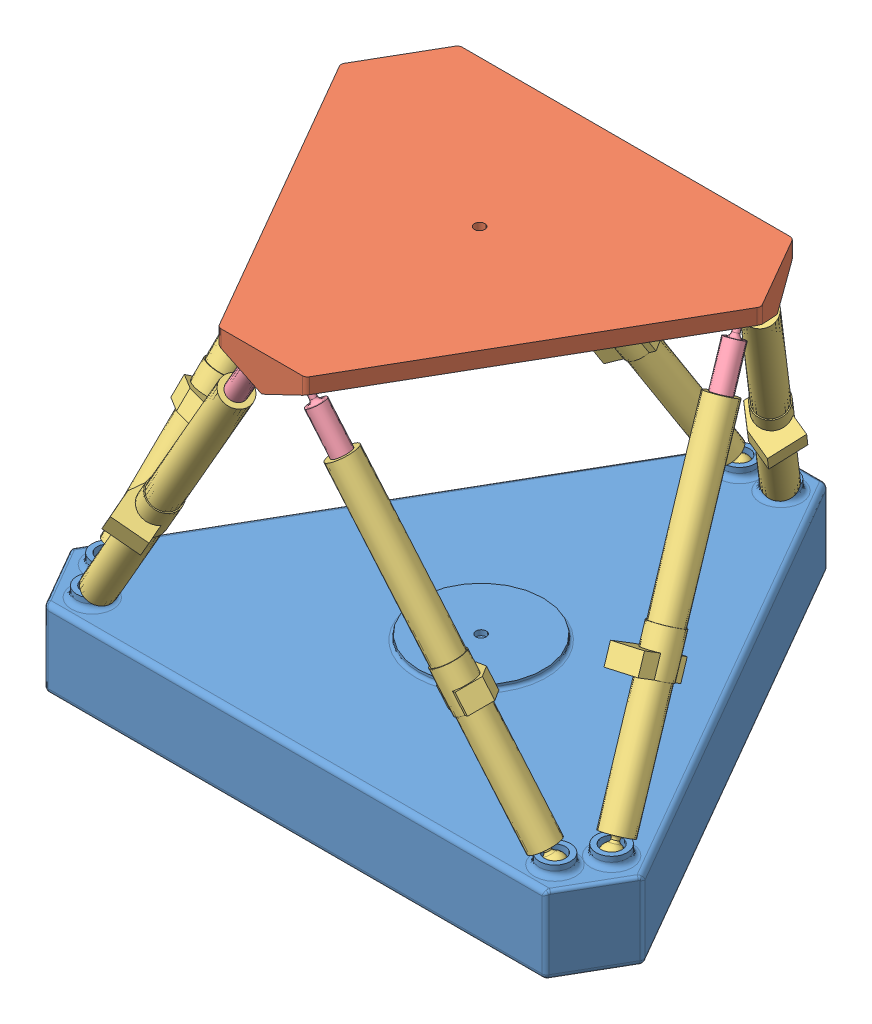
SolidWorks assembly 6axes.SLDASM, configuration Défaut (file format 4400). Lengths in mm.
Overall size (556.71 419.49 544.19).
14 component instances, 4 part files, 24 mates.
Components (placement in the parent):
- embase-1: embase.SLDPRT [Défaut] at (0 -80 0) size (550.45 85 478.05)
- plateforme-1: plateforme.SLDPRT [Défaut] at (-1.6309 324.4911 -0.1601) x (0.499978 0 0.866038) z (-0.866038 0 0.499978) size (404.45 35 351.61)
- alesage-1: alesage.SLDPRT [Défaut] at (20.0158 -5 -269.2534) x (0.278517 0.324523 -0.903943) z (0.895408 -0.428156 0.122176) size (36.78 335 45)
- tige-1: tige.SLDPRT [Défaut] at (90.6333 166.4569 -185.9407) x (0.687943 0.067774 -0.722594) z (0.63723 -0.532953 0.556685) size (20 191 20)
- alesage-2: alesage.SLDPRT [Défaut] at (-20.0022 -5 -269.2544) x (0.457484 -0.224967 0.86029) z (-0.815355 -0.492183 0.304882) size (36.78 335 45)
- tige-2: tige.SLDPRT [Défaut] at (-92.5409 166.9105 -185.7249) x (-0.933904 -0.339271 -0.112774) z (-0.04379 0.421603 -0.905722) size (20 191 20)
- alesage-7: alesage.SLDPRT [Défaut] at (-243.1881 -5 117.2925) x (0.140853 -0.53358 -0.833938) z (0.974435 -0.074203 0.212061) size (36.78 335 45)
- tige-7: tige.SLDPRT [Défaut] at (-207.5316 166.6266 13.5027) x (0.78955 0.18904 0.583844) z (-0.588195 0.504458 0.632099) size (20 191 20)
- alesage-8: alesage.SLDPRT [Défaut] at (-223.18 -5 151.9496) x (0.810499 -0.464373 -0.357001) z (0.255291 -0.268496 0.928836) size (36.78 335 45)
- tige-8: tige.SLDPRT [Défaut] at (-116.1398 166.3603 172.0641) x (-0.24313 0.261515 -0.934076) z (0.814229 -0.46834 -0.343057) size (20 191 20)
- alesage-9: alesage.SLDPRT [Défaut] at (223.1723 -5 151.9609) x (-0.285074 -0.288217 0.914146) z (-0.79646 -0.459386 -0.393212) size (36.78 335 45)
- tige-9: tige.SLDPRT [Défaut] at (113.9718 167.0451 172.1503) x (0.564308 0.440141 -0.69845) z (0.630216 0.316829 0.708834) size (20 191 20)
- alesage-10: alesage.SLDPRT [Défaut] at (243.1822 -5 117.3047) x (0.981464 0.186116 -0.045699) z (-0.056239 0.507667 0.859716) size (36.78 335 45)
- tige-10: tige.SLDPRT [Défaut] at (205.7533 166.8579 13.3733) x (0.290574 -0.448024 -0.845483) z (0.93915 0.30272 0.162352) size (20 191 20)
Mates (geometry in assembly coordinates):
- Coaxiale18: concentric: sphere of plateforme-1; sphere of tige-1
- Coaxiale2: concentric: sphere of embase-1; sphere of alesage-1
- Coaxiale3: concentric anti-aligned: cylinder of alesage-1 through (56.4907 83.5597 -226.2213) axis (0.34738 0.843426 0.409829) radius 9; cylinder of tige-1 through (146.2141 301.405 -120.368) axis (-0.34738 -0.843426 -0.409829) radius 9
- DistanceLimite1: limit distance = 40.2862 mm anti-aligned: plane of alesage-1 through (76.6387 132.4784 -202.4512) normal (0.34738 0.843426 0.409829); plane of tige-1 through (90.6333 166.4569 -185.9407) normal (-0.34738 -0.843426 -0.409829)
- DistanceLimite7: limit distance = 41.4315 mm anti-aligned: plane of tige-2 through (-92.5409 166.9105 -185.7249) normal (0.354831 -0.84092 -0.408594); plane of alesage-2 through (-77.8397 132.0699 -202.6536) normal (-0.354831 0.84092 0.408594)
- Coaxiale6: concentric anti-aligned: cylinder of alesage-2 through (-57.2595 83.2966 -226.352) axis (-0.354831 0.84092 0.408594) radius 9; cylinder of tige-2 through (-149.3139 301.4576 -120.3499) axis (0.354831 -0.84092 -0.408594) radius 9
- Coaxiale20: concentric: sphere of plateforme-1; sphere of tige-2
- Coaxiale19: concentric: sphere of embase-1; sphere of alesage-2
- Coaxiale21: concentric: sphere of plateforme-1; sphere of tige-7
- Coaxiale9: concentric anti-aligned: sphere of alesage-7; sphere of embase-1
- DistanceLimite3: limit distance = 40.714 mm anti-aligned: plane of tige-7 through (-207.5316 166.6266 13.5027) normal (-0.175032 -0.842488 0.509488); plane of alesage-7 through (-214.6579 132.3255 34.246) normal (0.175032 0.842488 -0.509488)
- Coaxiale22: concentric anti-aligned: cylinder of alesage-7 through (-224.8097 83.4612 63.7963) axis (0.175032 0.842488 -0.509488) radius 9; cylinder of tige-7 through (-179.5264 301.4247 -68.0153) axis (-0.175032 -0.842488 0.509488) radius 9
- Coaxiale24: concentric: sphere of plateforme-1; sphere of tige-8
- Coaxiale23: concentric: sphere of embase-1; sphere of alesage-8
- DistanceLimite4: limit distance = 40.0432 mm anti-aligned: plane of tige-8 through (-116.1398 166.3603 172.0641) normal (-0.52718 -0.84396 -0.099065); plane of alesage-8 through (-137.2497 132.5654 168.0973) normal (0.52718 0.84396 0.099065)
- Coaxiale11: concentric anti-aligned: cylinder of alesage-8 through (-167.8261 83.6158 162.3515) axis (0.52718 0.84396 0.099065) radius 9; cylinder of tige-8 through (-31.791 301.3938 187.9146) axis (-0.52718 -0.84396 -0.099065) radius 9
- Coaxiale25: concentric: sphere of embase-1; sphere of alesage-9
- DistanceLimite5: limit distance = 41.7728 mm anti-aligned: plane of tige-9 through (113.9718 167.0451 172.1503) normal (0.533276 -0.840176 -0.098594); plane of alesage-9 through (136.2483 131.9487 168.0318) normal (-0.533276 0.840176 0.098594)
- Coaxiale14: concentric anti-aligned: cylinder of alesage-9 through (167.1783 83.2185 162.3133) axis (-0.533276 0.840176 0.098594) radius 9; cylinder of tige-9 through (28.6476 301.4733 187.9254) axis (0.533276 -0.840176 -0.098594) radius 9
- Coaxiale28: concentric: sphere of plateforme-1; sphere of tige-9
- Coaxiale26: concentric: sphere of alesage-10; sphere of embase-1
- Coaxiale27: concentric: sphere of plateforme-1; sphere of tige-10
- DistanceLimite6: limit distance = 41.2983 mm anti-aligned: plane of alesage-10 through (213.3195 132.1173 34.3827) normal (-0.183207 0.84121 -0.508724); plane of tige-10 through (205.7533 166.8579 13.3733) normal (0.183207 -0.84121 0.508724)
- Coaxiale17: concentric anti-aligned: cylinder of alesage-10 through (223.9455 83.3271 63.8887) axis (-0.183207 0.84121 -0.508724) radius 9; cylinder of tige-10 through (176.4401 301.4515 -68.0225) axis (0.183207 -0.84121 0.508724) radius 9
